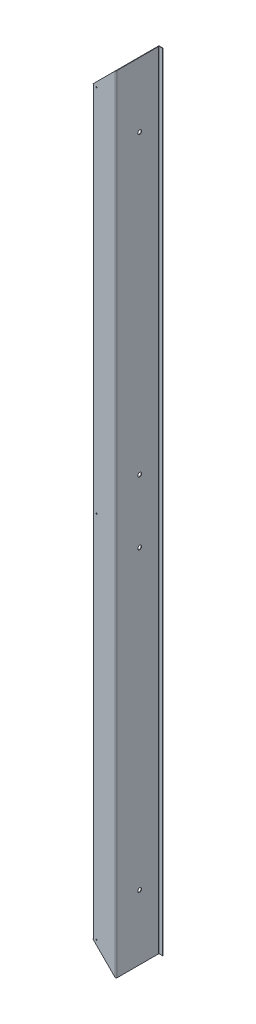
ISO-10303-21;
HEADER;
FILE_DESCRIPTION(('STEP AP214'),'2;1');
FILE_NAME('part.step','',(''),(''),'','','');
FILE_SCHEMA(('AUTOMOTIVE_DESIGN { 1 0 10303 214 1 1 1 1 }'));
ENDSEC;
DATA;
#1=APPLICATION_CONTEXT('core data for automotive mechanical design processes');
#2=APPLICATION_PROTOCOL_DEFINITION('international standard','automotive_design',2000,#1);
#3=PRODUCT_CONTEXT('',#1,'mechanical');
#4=PRODUCT('Part','Part','',(#3));
#5=PRODUCT_RELATED_PRODUCT_CATEGORY('part','',(#4));
#6=PRODUCT_DEFINITION_FORMATION('','',#4);
#7=PRODUCT_DEFINITION_CONTEXT('part definition',#1,'design');
#8=PRODUCT_DEFINITION('design','',#6,#7);
#9=PRODUCT_DEFINITION_SHAPE('','',#8);
#10=(LENGTH_UNIT() NAMED_UNIT(*) SI_UNIT(.MILLI.,.METRE.));
#11=(NAMED_UNIT(*) PLANE_ANGLE_UNIT() SI_UNIT($,.RADIAN.));
#12=(NAMED_UNIT(*) SI_UNIT($,.STERADIAN.) SOLID_ANGLE_UNIT());
#13=UNCERTAINTY_MEASURE_WITH_UNIT(LENGTH_MEASURE(1.E-05),#10,'distance_accuracy_value','');
#14=(GEOMETRIC_REPRESENTATION_CONTEXT(3) GLOBAL_UNCERTAINTY_ASSIGNED_CONTEXT((#13)) GLOBAL_UNIT_ASSIGNED_CONTEXT((#10,
#11,#12)) REPRESENTATION_CONTEXT('',''));
#15=CARTESIAN_POINT('',(0.,0.,0.));
#16=DIRECTION('',(0.,0.,1.));
#17=DIRECTION('',(1.,0.,0.));
#18=AXIS2_PLACEMENT_3D('',#15,#16,#17);
#19=CARTESIAN_POINT('',(457.5,1019.,-111.400000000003));
#20=DIRECTION('',(0.,1.,0.));
#21=DIRECTION('',(-1.,0.,0.));
#22=AXIS2_PLACEMENT_3D('',#19,#20,#21);
#23=PLANE('',#22);
#24=DIRECTION('',(0.,0.,-1.));
#25=VECTOR('',#24,1.);
#26=CARTESIAN_POINT('',(457.5,1019.,-111.400000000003));
#27=LINE('',#26,#25);
#28=CARTESIAN_POINT('',(457.499999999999,1019.,-0.99999999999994));
#29=VERTEX_POINT('',#28);
#30=CARTESIAN_POINT('',(457.5,1019.,-109.200000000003));
#31=VERTEX_POINT('',#30);
#32=EDGE_CURVE('E300',#29,#31,#27,.T.);
#33=ORIENTED_EDGE('',*,*,#32,.T.);
#34=DIRECTION('',(-1.,0.,0.));
#35=VECTOR('',#34,1.);
#36=CARTESIAN_POINT('',(457.5,1019.,-109.200000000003));
#37=LINE('',#36,#35);
#38=CARTESIAN_POINT('',(456.3,1019.,-109.200000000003));
#39=VERTEX_POINT('',#38);
#40=EDGE_CURVE('E284',#31,#39,#37,.T.);
#41=ORIENTED_EDGE('',*,*,#40,.T.);
#42=DIRECTION('',(0.,0.,1.));
#43=VECTOR('',#42,1.);
#44=CARTESIAN_POINT('',(456.299999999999,1019.,1.59582102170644E-12));
#45=LINE('',#44,#43);
#46=CARTESIAN_POINT('',(456.299999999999,1019.,-0.999999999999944));
#47=VERTEX_POINT('',#46);
#48=EDGE_CURVE('E304',#47,#39,#45,.F.);
#49=ORIENTED_EDGE('',*,*,#48,.F.);
#50=DIRECTION('',(1.,0.,0.));
#51=VECTOR('',#50,1.);
#52=CARTESIAN_POINT('',(457.499999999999,1019.,-1.));
#53=LINE('',#52,#51);
#54=EDGE_CURVE('E295',#47,#29,#53,.T.);
#55=ORIENTED_EDGE('',*,*,#54,.T.);
#56=EDGE_LOOP('',(#33,#41,#49,#55));
#57=FACE_BOUND('',#56,.T.);
#58=ADVANCED_FACE('F101',(#57),#23,.T.);
#59=CARTESIAN_POINT('',(457.499999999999,0.,1.60001079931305E-12));
#60=DIRECTION('',(1.,0.,0.));
#61=DIRECTION('',(0.,0.,-1.));
#62=AXIS2_PLACEMENT_3D('',#59,#60,#61);
#63=PLANE('',#62);
#64=CARTESIAN_POINT('',(457.5,-850.999999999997,-60.2999999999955));
#65=DIRECTION('',(1.,0.,0.));
#66=DIRECTION('',(0.,0.,-1.));
#67=AXIS2_PLACEMENT_3D('',#64,#65,#66);
#68=CIRCLE('',#67,5.00000000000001);
#69=CARTESIAN_POINT('',(457.5,-850.999999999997,-65.2999999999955));
#70=VERTEX_POINT('',#69);
#71=EDGE_CURVE('E503',#70,#70,#68,.T.);
#72=ORIENTED_EDGE('',*,*,#71,.F.);
#73=EDGE_LOOP('',(#72));
#74=FACE_BOUND('',#73,.T.);
#75=CARTESIAN_POINT('',(457.499999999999,851.000000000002,-60.2999999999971));
#76=DIRECTION('',(1.,0.,0.));
#77=DIRECTION('',(0.,0.,-1.));
#78=AXIS2_PLACEMENT_3D('',#75,#76,#77);
#79=CIRCLE('',#78,5.00000000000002);
#80=CARTESIAN_POINT('',(457.499999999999,851.000000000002,-65.2999999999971));
#81=VERTEX_POINT('',#80);
#82=EDGE_CURVE('E504',#81,#81,#79,.T.);
#83=ORIENTED_EDGE('',*,*,#82,.F.);
#84=EDGE_LOOP('',(#83));
#85=FACE_BOUND('',#84,.T.);
#86=CARTESIAN_POINT('',(457.5,81.799999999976,-60.2999999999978));
#87=DIRECTION('',(1.,0.,0.));
#88=DIRECTION('',(0.,0.,1.));
#89=AXIS2_PLACEMENT_3D('',#86,#87,#88);
#90=CIRCLE('',#89,5.00000000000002);
#91=CARTESIAN_POINT('',(457.5,81.799999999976,-55.2999999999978));
#92=VERTEX_POINT('',#91);
#93=EDGE_CURVE('E514',#92,#92,#90,.T.);
#94=ORIENTED_EDGE('',*,*,#93,.F.);
#95=EDGE_LOOP('',(#94));
#96=FACE_BOUND('',#95,.T.);
#97=CARTESIAN_POINT('',(457.5,-81.799999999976,-60.2999999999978));
#98=DIRECTION('',(1.,0.,0.));
#99=DIRECTION('',(0.,0.,-1.));
#100=AXIS2_PLACEMENT_3D('',#97,#98,#99);
#101=CIRCLE('',#100,5.00000000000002);
#102=CARTESIAN_POINT('',(457.5,-81.799999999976,-65.2999999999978));
#103=VERTEX_POINT('',#102);
#104=EDGE_CURVE('E496',#103,#103,#101,.T.);
#105=ORIENTED_EDGE('',*,*,#104,.F.);
#106=EDGE_LOOP('',(#105));
#107=FACE_BOUND('',#106,.T.);
#108=DIRECTION('',(0.,0.,1.));
#109=VECTOR('',#108,1.);
#110=CARTESIAN_POINT('',(457.499999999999,-1019.,3.78673207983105E-13));
#111=LINE('',#110,#109);
#112=CARTESIAN_POINT('',(457.5,-1019.,-109.200000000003));
#113=VERTEX_POINT('',#112);
#114=CARTESIAN_POINT('',(457.499999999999,-1019.,-0.999999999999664));
#115=VERTEX_POINT('',#114);
#116=EDGE_CURVE('E297',#113,#115,#111,.T.);
#117=ORIENTED_EDGE('',*,*,#116,.F.);
#118=DIRECTION('',(0.,1.,0.));
#119=VECTOR('',#118,1.);
#120=CARTESIAN_POINT('',(457.5,1019.,-109.200000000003));
#121=LINE('',#120,#119);
#122=EDGE_CURVE('E125',#31,#113,#121,.F.);
#123=ORIENTED_EDGE('',*,*,#122,.F.);
#124=ORIENTED_EDGE('',*,*,#32,.F.);
#125=DIRECTION('',(0.,-1.,0.));
#126=VECTOR('',#125,1.);
#127=CARTESIAN_POINT('',(457.499999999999,0.,-0.99999999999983));
#128=LINE('',#127,#126);
#129=EDGE_CURVE('E307',#29,#115,#128,.T.);
#130=ORIENTED_EDGE('',*,*,#129,.T.);
#131=EDGE_LOOP('',(#117,#123,#124,#130));
#132=FACE_BOUND('',#131,.T.);
#133=ADVANCED_FACE('F454',(#74,#85,#96,#107,#132),#63,.T.);
#134=CARTESIAN_POINT('',(456.299999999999,0.,1.59582102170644E-12));
#135=DIRECTION('',(1.,0.,0.));
#136=DIRECTION('',(0.,0.,-1.));
#137=AXIS2_PLACEMENT_3D('',#134,#135,#136);
#138=PLANE('',#137);
#139=CARTESIAN_POINT('',(456.3,-850.999999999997,-60.2999999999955));
#140=DIRECTION('',(1.,0.,0.));
#141=DIRECTION('',(0.,0.,-1.));
#142=AXIS2_PLACEMENT_3D('',#139,#140,#141);
#143=CIRCLE('',#142,5.00000000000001);
#144=CARTESIAN_POINT('',(456.3,-850.999999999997,-65.2999999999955));
#145=VERTEX_POINT('',#144);
#146=EDGE_CURVE('E499',#145,#145,#143,.F.);
#147=ORIENTED_EDGE('',*,*,#146,.F.);
#148=EDGE_LOOP('',(#147));
#149=FACE_BOUND('',#148,.T.);
#150=CARTESIAN_POINT('',(456.3,851.000000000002,-60.2999999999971));
#151=DIRECTION('',(1.,0.,0.));
#152=DIRECTION('',(0.,0.,-1.));
#153=AXIS2_PLACEMENT_3D('',#150,#151,#152);
#154=CIRCLE('',#153,5.00000000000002);
#155=CARTESIAN_POINT('',(456.3,851.000000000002,-65.2999999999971));
#156=VERTEX_POINT('',#155);
#157=EDGE_CURVE('E500',#156,#156,#154,.F.);
#158=ORIENTED_EDGE('',*,*,#157,.F.);
#159=EDGE_LOOP('',(#158));
#160=FACE_BOUND('',#159,.T.);
#161=CARTESIAN_POINT('',(456.3,81.799999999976,-60.2999999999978));
#162=DIRECTION('',(1.,0.,0.));
#163=DIRECTION('',(0.,0.,-1.));
#164=AXIS2_PLACEMENT_3D('',#161,#162,#163);
#165=CIRCLE('',#164,5.00000000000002);
#166=CARTESIAN_POINT('',(456.3,81.799999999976,-65.2999999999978));
#167=VERTEX_POINT('',#166);
#168=EDGE_CURVE('E507',#167,#167,#165,.F.);
#169=ORIENTED_EDGE('',*,*,#168,.F.);
#170=EDGE_LOOP('',(#169));
#171=FACE_BOUND('',#170,.T.);
#172=CARTESIAN_POINT('',(456.3,-81.799999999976,-60.2999999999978));
#173=DIRECTION('',(1.,0.,0.));
#174=DIRECTION('',(0.,0.,-1.));
#175=AXIS2_PLACEMENT_3D('',#172,#173,#174);
#176=CIRCLE('',#175,5.00000000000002);
#177=CARTESIAN_POINT('',(456.3,-81.799999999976,-65.2999999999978));
#178=VERTEX_POINT('',#177);
#179=EDGE_CURVE('E481',#178,#178,#176,.F.);
#180=ORIENTED_EDGE('',*,*,#179,.F.);
#181=EDGE_LOOP('',(#180));
#182=FACE_BOUND('',#181,.T.);
#183=DIRECTION('',(0.,1.,0.));
#184=VECTOR('',#183,1.);
#185=CARTESIAN_POINT('',(456.3,1019.,-109.200000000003));
#186=LINE('',#185,#184);
#187=CARTESIAN_POINT('',(456.3,-1019.,-109.200000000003));
#188=VERTEX_POINT('',#187);
#189=EDGE_CURVE('E278',#39,#188,#186,.F.);
#190=ORIENTED_EDGE('',*,*,#189,.T.);
#191=DIRECTION('',(0.,0.,-1.));
#192=VECTOR('',#191,1.);
#193=CARTESIAN_POINT('',(456.299999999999,-1019.,1.59582102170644E-12));
#194=LINE('',#193,#192);
#195=CARTESIAN_POINT('',(456.299999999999,-1019.,-0.999999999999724));
#196=VERTEX_POINT('',#195);
#197=EDGE_CURVE('E302',#188,#196,#194,.F.);
#198=ORIENTED_EDGE('',*,*,#197,.T.);
#199=DIRECTION('',(0.,1.,0.));
#200=VECTOR('',#199,1.);
#201=CARTESIAN_POINT('',(456.299999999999,1019.,-1.));
#202=LINE('',#201,#200);
#203=EDGE_CURVE('E313',#47,#196,#202,.F.);
#204=ORIENTED_EDGE('',*,*,#203,.F.);
#205=ORIENTED_EDGE('',*,*,#48,.T.);
#206=EDGE_LOOP('',(#190,#198,#204,#205));
#207=FACE_BOUND('',#206,.T.);
#208=ADVANCED_FACE('F443',(#149,#160,#171,#182,#207),#138,.F.);
#209=CARTESIAN_POINT('',(0.,0.,1.2));
#210=DIRECTION('',(0.,0.,-1.));
#211=DIRECTION('',(-1.,0.,0.));
#212=AXIS2_PLACEMENT_3D('',#209,#210,#211);
#213=PLANE('',#212);
#214=CARTESIAN_POINT('',(407.100000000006,-957.299999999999,1.2));
#215=DIRECTION('',(0.,0.,1.));
#216=DIRECTION('',(1.,0.,0.));
#217=AXIS2_PLACEMENT_3D('',#214,#215,#216);
#218=CIRCLE('',#217,1.50000000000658);
#219=CARTESIAN_POINT('',(408.600000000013,-957.299999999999,1.2));
#220=VERTEX_POINT('',#219);
#221=EDGE_CURVE('E490',#220,#220,#218,.T.);
#222=ORIENTED_EDGE('',*,*,#221,.F.);
#223=EDGE_LOOP('',(#222));
#224=FACE_BOUND('',#223,.T.);
#225=CARTESIAN_POINT('',(407.100000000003,0.,1.2));
#226=DIRECTION('',(0.,0.,1.));
#227=DIRECTION('',(1.,0.,0.));
#228=AXIS2_PLACEMENT_3D('',#225,#226,#227);
#229=CIRCLE('',#228,1.50000000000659);
#230=CARTESIAN_POINT('',(408.60000000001,0.,1.2));
#231=VERTEX_POINT('',#230);
#232=EDGE_CURVE('E484',#231,#231,#229,.T.);
#233=ORIENTED_EDGE('',*,*,#232,.F.);
#234=EDGE_LOOP('',(#233));
#235=FACE_BOUND('',#234,.T.);
#236=CARTESIAN_POINT('',(407.1,957.299999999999,1.2));
#237=DIRECTION('',(0.,0.,1.));
#238=DIRECTION('',(1.,0.,0.));
#239=AXIS2_PLACEMENT_3D('',#236,#237,#238);
#240=CIRCLE('',#239,1.50000000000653);
#241=CARTESIAN_POINT('',(408.600000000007,957.299999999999,1.2));
#242=VERTEX_POINT('',#241);
#243=EDGE_CURVE('E477',#242,#242,#240,.T.);
#244=ORIENTED_EDGE('',*,*,#243,.F.);
#245=EDGE_LOOP('',(#244));
#246=FACE_BOUND('',#245,.T.);
#247=DIRECTION('',(0.,-1.,0.));
#248=VECTOR('',#247,1.);
#249=CARTESIAN_POINT('',(455.299999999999,-1019.,1.20000000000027));
#250=LINE('',#249,#248);
#251=CARTESIAN_POINT('',(455.299999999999,-1018.,1.20000000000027));
#252=VERTEX_POINT('',#251);
#253=CARTESIAN_POINT('',(455.299999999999,1018.,1.2));
#254=VERTEX_POINT('',#253);
#255=EDGE_CURVE('E322',#252,#254,#250,.F.);
#256=ORIENTED_EDGE('',*,*,#255,.T.);
#257=DIRECTION('',(-0.707106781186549,-0.707106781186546,0.));
#258=VECTOR('',#257,1.);
#259=CARTESIAN_POINT('',(397.499999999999,960.2,1.2));
#260=LINE('',#259,#258);
#261=CARTESIAN_POINT('',(397.499999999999,960.2,1.2));
#262=VERTEX_POINT('',#261);
#263=EDGE_CURVE('E330',#254,#262,#260,.T.);
#264=ORIENTED_EDGE('',*,*,#263,.T.);
#265=DIRECTION('',(-1.,0.,0.));
#266=VECTOR('',#265,1.);
#267=CARTESIAN_POINT('',(0.,960.2,1.2));
#268=LINE('',#267,#266);
#269=CARTESIAN_POINT('',(399.699999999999,960.2,1.2));
#270=VERTEX_POINT('',#269);
#271=EDGE_CURVE('E1048',#270,#262,#268,.T.);
#272=ORIENTED_EDGE('',*,*,#271,.F.);
#273=DIRECTION('',(0.,1.,0.));
#274=VECTOR('',#273,1.);
#275=CARTESIAN_POINT('',(399.699999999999,960.2,1.19999999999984));
#276=LINE('',#275,#274);
#277=CARTESIAN_POINT('',(399.699999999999,-960.199999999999,1.2));
#278=VERTEX_POINT('',#277);
#279=EDGE_CURVE('E1016',#270,#278,#276,.F.);
#280=ORIENTED_EDGE('',*,*,#279,.T.);
#281=DIRECTION('',(1.,0.,0.));
#282=VECTOR('',#281,1.);
#283=CARTESIAN_POINT('',(0.,-960.199999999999,1.2));
#284=LINE('',#283,#282);
#285=CARTESIAN_POINT('',(397.499999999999,-960.199999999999,1.2));
#286=VERTEX_POINT('',#285);
#287=EDGE_CURVE('E992',#286,#278,#284,.T.);
#288=ORIENTED_EDGE('',*,*,#287,.F.);
#289=DIRECTION('',(0.707106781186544,-0.707106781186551,0.));
#290=VECTOR('',#289,1.);
#291=CARTESIAN_POINT('',(397.499999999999,-960.199999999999,1.2));
#292=LINE('',#291,#290);
#293=EDGE_CURVE('E1019',#286,#252,#292,.T.);
#294=ORIENTED_EDGE('',*,*,#293,.T.);
#295=EDGE_LOOP('',(#256,#264,#272,#280,#288,#294));
#296=FACE_BOUND('',#295,.T.);
#297=ADVANCED_FACE('F440',(#224,#235,#246,#296),#213,.F.);
#298=CARTESIAN_POINT('',(0.,0.,0.));
#299=DIRECTION('',(0.,0.,-1.));
#300=DIRECTION('',(-1.,0.,0.));
#301=AXIS2_PLACEMENT_3D('',#298,#299,#300);
#302=PLANE('',#301);
#303=CARTESIAN_POINT('',(407.100000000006,-957.299999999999,0.));
#304=DIRECTION('',(0.,0.,1.));
#305=DIRECTION('',(1.,0.,0.));
#306=AXIS2_PLACEMENT_3D('',#303,#304,#305);
#307=CIRCLE('',#306,1.50000000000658);
#308=CARTESIAN_POINT('',(408.600000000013,-957.299999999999,0.));
#309=VERTEX_POINT('',#308);
#310=EDGE_CURVE('E277',#309,#309,#307,.T.);
#311=ORIENTED_EDGE('',*,*,#310,.T.);
#312=EDGE_LOOP('',(#311));
#313=FACE_BOUND('',#312,.T.);
#314=CARTESIAN_POINT('',(407.100000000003,0.,0.));
#315=DIRECTION('',(0.,0.,1.));
#316=DIRECTION('',(1.,0.,0.));
#317=AXIS2_PLACEMENT_3D('',#314,#315,#316);
#318=CIRCLE('',#317,1.50000000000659);
#319=CARTESIAN_POINT('',(408.60000000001,0.,0.));
#320=VERTEX_POINT('',#319);
#321=EDGE_CURVE('E487',#320,#320,#318,.T.);
#322=ORIENTED_EDGE('',*,*,#321,.T.);
#323=EDGE_LOOP('',(#322));
#324=FACE_BOUND('',#323,.T.);
#325=CARTESIAN_POINT('',(407.1,957.299999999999,0.));
#326=DIRECTION('',(0.,0.,1.));
#327=DIRECTION('',(1.,0.,0.));
#328=AXIS2_PLACEMENT_3D('',#325,#326,#327);
#329=CIRCLE('',#328,1.50000000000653);
#330=CARTESIAN_POINT('',(408.600000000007,957.299999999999,0.));
#331=VERTEX_POINT('',#330);
#332=EDGE_CURVE('E480',#331,#331,#329,.T.);
#333=ORIENTED_EDGE('',*,*,#332,.T.);
#334=EDGE_LOOP('',(#333));
#335=FACE_BOUND('',#334,.T.);
#336=DIRECTION('',(-0.707106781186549,-0.707106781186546,0.));
#337=VECTOR('',#336,1.);
#338=CARTESIAN_POINT('',(397.499999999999,960.2,0.));
#339=LINE('',#338,#337);
#340=CARTESIAN_POINT('',(455.299999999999,1018.,0.));
#341=VERTEX_POINT('',#340);
#342=CARTESIAN_POINT('',(397.499999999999,960.2,0.));
#343=VERTEX_POINT('',#342);
#344=EDGE_CURVE('E105',#341,#343,#339,.T.);
#345=ORIENTED_EDGE('',*,*,#344,.F.);
#346=DIRECTION('',(0.,-1.,0.));
#347=VECTOR('',#346,1.);
#348=CARTESIAN_POINT('',(455.299999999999,-1019.,2.73652628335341E-13));
#349=LINE('',#348,#347);
#350=CARTESIAN_POINT('',(455.299999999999,-1018.,2.73598418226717E-13));
#351=VERTEX_POINT('',#350);
#352=EDGE_CURVE('E318',#351,#341,#349,.F.);
#353=ORIENTED_EDGE('',*,*,#352,.F.);
#354=DIRECTION('',(0.707106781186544,-0.707106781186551,0.));
#355=VECTOR('',#354,1.);
#356=CARTESIAN_POINT('',(397.499999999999,-960.199999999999,0.));
#357=LINE('',#356,#355);
#358=CARTESIAN_POINT('',(397.499999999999,-960.199999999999,0.));
#359=VERTEX_POINT('',#358);
#360=EDGE_CURVE('E999',#359,#351,#357,.T.);
#361=ORIENTED_EDGE('',*,*,#360,.F.);
#362=DIRECTION('',(-1.,0.,0.));
#363=VECTOR('',#362,1.);
#364=CARTESIAN_POINT('',(399.699999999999,-960.199999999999,0.));
#365=LINE('',#364,#363);
#366=CARTESIAN_POINT('',(397.740408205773,-960.199999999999,0.));
#367=VERTEX_POINT('',#366);
#368=EDGE_CURVE('E986',#367,#359,#365,.T.);
#369=ORIENTED_EDGE('',*,*,#368,.F.);
#370=CARTESIAN_POINT('',(399.699999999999,-960.199999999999,0.));
#371=VERTEX_POINT('',#370);
#372=EDGE_CURVE('E985',#371,#367,#365,.T.);
#373=ORIENTED_EDGE('',*,*,#372,.F.);
#374=DIRECTION('',(0.,1.,0.));
#375=VECTOR('',#374,1.);
#376=CARTESIAN_POINT('',(399.699999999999,960.2,-1.59811400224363E-13));
#377=LINE('',#376,#375);
#378=CARTESIAN_POINT('',(399.699999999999,960.2,-1.59811400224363E-13));
#379=VERTEX_POINT('',#378);
#380=EDGE_CURVE('E1006',#379,#371,#377,.F.);
#381=ORIENTED_EDGE('',*,*,#380,.F.);
#382=DIRECTION('',(1.,0.,0.));
#383=VECTOR('',#382,1.);
#384=CARTESIAN_POINT('',(397.499999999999,960.2,0.));
#385=LINE('',#384,#383);
#386=CARTESIAN_POINT('',(397.740408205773,960.2,0.));
#387=VERTEX_POINT('',#386);
#388=EDGE_CURVE('E1000',#387,#379,#385,.T.);
#389=ORIENTED_EDGE('',*,*,#388,.F.);
#390=EDGE_CURVE('E984',#343,#387,#385,.T.);
#391=ORIENTED_EDGE('',*,*,#390,.F.);
#392=EDGE_LOOP('',(#345,#353,#361,#369,#373,#381,#389,#391));
#393=FACE_BOUND('',#392,.T.);
#394=ADVANCED_FACE('F442',(#313,#324,#335,#393),#302,.T.);
#395=CARTESIAN_POINT('',(397.499999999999,-960.199999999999,1.2));
#396=DIRECTION('',(0.707106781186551,0.707106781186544,0.));
#397=DIRECTION('',(-0.707106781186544,0.707106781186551,0.));
#398=AXIS2_PLACEMENT_3D('',#395,#396,#397);
#399=PLANE('',#398);
#400=DIRECTION('',(0.,0.,1.));
#401=VECTOR('',#400,1.);
#402=CARTESIAN_POINT('',(455.299999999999,-1018.,2.73544208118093E-13));
#403=LINE('',#402,#401);
#404=EDGE_CURVE('E331',#351,#252,#403,.T.);
#405=ORIENTED_EDGE('',*,*,#404,.T.);
#406=ORIENTED_EDGE('',*,*,#293,.F.);
#407=DIRECTION('',(0.,0.,-1.));
#408=VECTOR('',#407,1.);
#409=CARTESIAN_POINT('',(397.499999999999,-960.199999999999,1.2));
#410=LINE('',#409,#408);
#411=EDGE_CURVE('E378',#286,#359,#410,.T.);
#412=ORIENTED_EDGE('',*,*,#411,.T.);
#413=ORIENTED_EDGE('',*,*,#360,.T.);
#414=EDGE_LOOP('',(#405,#406,#412,#413));
#415=FACE_BOUND('',#414,.T.);
#416=ADVANCED_FACE('F103',(#415),#399,.F.);
#417=CARTESIAN_POINT('',(397.499999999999,960.2,0.));
#418=DIRECTION('',(0.,-1.,0.));
#419=DIRECTION('',(0.,0.,-1.));
#420=AXIS2_PLACEMENT_3D('',#417,#418,#419);
#421=PLANE('',#420);
#422=ORIENTED_EDGE('',*,*,#390,.T.);
#423=CARTESIAN_POINT('',(399.699999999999,960.2,-1.00000000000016));
#424=DIRECTION('',(0.,1.,0.));
#425=DIRECTION('',(0.,0.,1.));
#426=AXIS2_PLACEMENT_3D('',#423,#424,#425);
#427=CIRCLE('',#426,2.2);
#428=EDGE_CURVE('E998',#387,#270,#427,.T.);
#429=ORIENTED_EDGE('',*,*,#428,.T.);
#430=ORIENTED_EDGE('',*,*,#271,.T.);
#431=DIRECTION('',(0.,0.,-1.));
#432=VECTOR('',#431,1.);
#433=CARTESIAN_POINT('',(397.499999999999,960.2,1.2));
#434=LINE('',#433,#432);
#435=EDGE_CURVE('E1050',#262,#343,#434,.T.);
#436=ORIENTED_EDGE('',*,*,#435,.T.);
#437=EDGE_LOOP('',(#422,#429,#430,#436));
#438=FACE_BOUND('',#437,.T.);
#439=ADVANCED_FACE('F386',(#438),#421,.T.);
#440=CARTESIAN_POINT('',(399.699999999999,-960.199999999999,0.));
#441=DIRECTION('',(0.,1.,0.));
#442=DIRECTION('',(0.,0.,1.));
#443=AXIS2_PLACEMENT_3D('',#440,#441,#442);
#444=PLANE('',#443);
#445=ORIENTED_EDGE('',*,*,#287,.T.);
#446=CARTESIAN_POINT('',(399.699999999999,-960.199999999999,-0.999999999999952));
#447=DIRECTION('',(0.,1.,0.));
#448=DIRECTION('',(0.,0.,1.));
#449=AXIS2_PLACEMENT_3D('',#446,#447,#448);
#450=CIRCLE('',#449,2.2);
#451=EDGE_CURVE('E990',#278,#367,#450,.F.);
#452=ORIENTED_EDGE('',*,*,#451,.T.);
#453=ORIENTED_EDGE('',*,*,#368,.T.);
#454=ORIENTED_EDGE('',*,*,#411,.F.);
#455=EDGE_LOOP('',(#445,#452,#453,#454));
#456=FACE_BOUND('',#455,.T.);
#457=ADVANCED_FACE('F395',(#456),#444,.T.);
#458=CARTESIAN_POINT('',(397.499999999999,960.2,1.2));
#459=DIRECTION('',(0.707106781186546,-0.707106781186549,0.));
#460=DIRECTION('',(0.707106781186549,0.707106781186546,0.));
#461=AXIS2_PLACEMENT_3D('',#458,#459,#460);
#462=PLANE('',#461);
#463=ORIENTED_EDGE('',*,*,#263,.F.);
#464=DIRECTION('',(0.,0.,1.));
#465=VECTOR('',#464,1.);
#466=CARTESIAN_POINT('',(455.299999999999,1018.,0.));
#467=LINE('',#466,#465);
#468=EDGE_CURVE('E327',#341,#254,#467,.T.);
#469=ORIENTED_EDGE('',*,*,#468,.F.);
#470=ORIENTED_EDGE('',*,*,#344,.T.);
#471=ORIENTED_EDGE('',*,*,#435,.F.);
#472=EDGE_LOOP('',(#463,#469,#470,#471));
#473=FACE_BOUND('',#472,.T.);
#474=ADVANCED_FACE('F399',(#473),#462,.F.);
#475=CARTESIAN_POINT('',(399.699999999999,-960.199999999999,-0.999999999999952));
#476=DIRECTION('',(0.,-1.,0.));
#477=DIRECTION('',(0.,0.,-1.));
#478=AXIS2_PLACEMENT_3D('',#475,#476,#477);
#479=PLANE('',#478);
#480=CARTESIAN_POINT('',(399.699999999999,-960.199999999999,-0.999999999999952));
#481=DIRECTION('',(0.,1.,0.));
#482=DIRECTION('',(0.,0.,1.));
#483=AXIS2_PLACEMENT_3D('',#480,#481,#482);
#484=CIRCLE('',#483,1.);
#485=CARTESIAN_POINT('',(398.699999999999,-960.199999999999,-0.999999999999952));
#486=VERTEX_POINT('',#485);
#487=EDGE_CURVE('E1009',#371,#486,#484,.F.);
#488=ORIENTED_EDGE('',*,*,#487,.F.);
#489=ORIENTED_EDGE('',*,*,#372,.T.);
#490=CARTESIAN_POINT('',(397.499999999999,-960.199999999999,-0.999999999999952));
#491=VERTEX_POINT('',#490);
#492=EDGE_CURVE('E988',#367,#491,#450,.F.);
#493=ORIENTED_EDGE('',*,*,#492,.T.);
#494=DIRECTION('',(-1.,0.,0.));
#495=VECTOR('',#494,1.);
#496=CARTESIAN_POINT('',(397.499999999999,-960.199999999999,-1.));
#497=LINE('',#496,#495);
#498=EDGE_CURVE('E1020',#486,#491,#497,.T.);
#499=ORIENTED_EDGE('',*,*,#498,.F.);
#500=EDGE_LOOP('',(#488,#489,#493,#499));
#501=FACE_BOUND('',#500,.T.);
#502=ADVANCED_FACE('F405',(#501),#479,.T.);
#503=CARTESIAN_POINT('',(399.699999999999,960.2,-1.00000000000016));
#504=DIRECTION('',(0.,-1.,0.));
#505=DIRECTION('',(0.,0.,-1.));
#506=AXIS2_PLACEMENT_3D('',#503,#504,#505);
#507=PLANE('',#506);
#508=CARTESIAN_POINT('',(397.499999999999,960.2,-1.00000000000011));
#509=VERTEX_POINT('',#508);
#510=EDGE_CURVE('E1013',#509,#387,#427,.T.);
#511=ORIENTED_EDGE('',*,*,#510,.T.);
#512=ORIENTED_EDGE('',*,*,#388,.T.);
#513=CARTESIAN_POINT('',(399.699999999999,960.2,-1.00000000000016));
#514=DIRECTION('',(0.,1.,0.));
#515=DIRECTION('',(0.,0.,1.));
#516=AXIS2_PLACEMENT_3D('',#513,#514,#515);
#517=CIRCLE('',#516,1.);
#518=CARTESIAN_POINT('',(398.699999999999,960.2,-1.00000000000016));
#519=VERTEX_POINT('',#518);
#520=EDGE_CURVE('E1001',#519,#379,#517,.T.);
#521=ORIENTED_EDGE('',*,*,#520,.F.);
#522=DIRECTION('',(-1.,0.,0.));
#523=VECTOR('',#522,1.);
#524=CARTESIAN_POINT('',(398.699999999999,960.2,-1.00000000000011));
#525=LINE('',#524,#523);
#526=EDGE_CURVE('E1010',#519,#509,#525,.T.);
#527=ORIENTED_EDGE('',*,*,#526,.T.);
#528=EDGE_LOOP('',(#511,#512,#521,#527));
#529=FACE_BOUND('',#528,.T.);
#530=ADVANCED_FACE('F401',(#529),#507,.F.);
#531=CARTESIAN_POINT('',(399.699999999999,960.2,-1.00000000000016));
#532=DIRECTION('',(0.,1.,0.));
#533=DIRECTION('',(-1.,0.,0.));
#534=AXIS2_PLACEMENT_3D('',#531,#532,#533);
#535=CYLINDRICAL_SURFACE('',#534,2.2);
#536=ORIENTED_EDGE('',*,*,#279,.F.);
#537=ORIENTED_EDGE('',*,*,#428,.F.);
#538=ORIENTED_EDGE('',*,*,#510,.F.);
#539=DIRECTION('',(0.,1.,0.));
#540=VECTOR('',#539,1.);
#541=CARTESIAN_POINT('',(397.499999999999,0.,-1.00000000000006));
#542=LINE('',#541,#540);
#543=EDGE_CURVE('E1027',#491,#509,#542,.T.);
#544=ORIENTED_EDGE('',*,*,#543,.F.);
#545=ORIENTED_EDGE('',*,*,#492,.F.);
#546=ORIENTED_EDGE('',*,*,#451,.F.);
#547=EDGE_LOOP('',(#536,#537,#538,#544,#545,#546));
#548=FACE_BOUND('',#547,.T.);
#549=ADVANCED_FACE('F404',(#548),#535,.T.);
#550=CARTESIAN_POINT('',(399.699999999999,960.2,-1.00000000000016));
#551=DIRECTION('',(0.,1.,0.));
#552=DIRECTION('',(-1.,0.,0.));
#553=AXIS2_PLACEMENT_3D('',#550,#551,#552);
#554=CYLINDRICAL_SURFACE('',#553,1.);
#555=ORIENTED_EDGE('',*,*,#380,.T.);
#556=ORIENTED_EDGE('',*,*,#487,.T.);
#557=DIRECTION('',(0.,-1.,0.));
#558=VECTOR('',#557,1.);
#559=CARTESIAN_POINT('',(398.699999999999,-960.199999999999,-1.));
#560=LINE('',#559,#558);
#561=EDGE_CURVE('E1005',#486,#519,#560,.F.);
#562=ORIENTED_EDGE('',*,*,#561,.T.);
#563=ORIENTED_EDGE('',*,*,#520,.T.);
#564=EDGE_LOOP('',(#555,#556,#562,#563));
#565=FACE_BOUND('',#564,.T.);
#566=ADVANCED_FACE('F410',(#565),#554,.F.);
#567=CARTESIAN_POINT('',(397.499999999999,960.2,0.));
#568=DIRECTION('',(0.,1.,0.));
#569=DIRECTION('',(0.,0.,1.));
#570=AXIS2_PLACEMENT_3D('',#567,#568,#569);
#571=PLANE('',#570);
#572=DIRECTION('',(0.,0.,1.));
#573=VECTOR('',#572,1.);
#574=CARTESIAN_POINT('',(397.499999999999,960.2,0.));
#575=LINE('',#574,#573);
#576=CARTESIAN_POINT('',(397.499999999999,960.2,-9.8));
#577=VERTEX_POINT('',#576);
#578=EDGE_CURVE('E1004',#577,#509,#575,.T.);
#579=ORIENTED_EDGE('',*,*,#578,.T.);
#580=ORIENTED_EDGE('',*,*,#526,.F.);
#581=DIRECTION('',(0.,0.,-1.));
#582=VECTOR('',#581,1.);
#583=CARTESIAN_POINT('',(398.699999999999,960.2,2.17558397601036E-11));
#584=LINE('',#583,#582);
#585=CARTESIAN_POINT('',(398.699999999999,960.2,-9.8));
#586=VERTEX_POINT('',#585);
#587=EDGE_CURVE('E1036',#586,#519,#584,.F.);
#588=ORIENTED_EDGE('',*,*,#587,.F.);
#589=DIRECTION('',(1.,0.,0.));
#590=VECTOR('',#589,1.);
#591=CARTESIAN_POINT('',(397.499999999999,960.2,-9.8));
#592=LINE('',#591,#590);
#593=EDGE_CURVE('E13',#577,#586,#592,.T.);
#594=ORIENTED_EDGE('',*,*,#593,.F.);
#595=EDGE_LOOP('',(#579,#580,#588,#594));
#596=FACE_BOUND('',#595,.T.);
#597=ADVANCED_FACE('F413',(#596),#571,.T.);
#598=CARTESIAN_POINT('',(397.499999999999,-960.199999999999,-9.8));
#599=DIRECTION('',(0.,-1.,0.));
#600=DIRECTION('',(1.,0.,0.));
#601=AXIS2_PLACEMENT_3D('',#598,#599,#600);
#602=PLANE('',#601);
#603=DIRECTION('',(0.,0.,1.));
#604=VECTOR('',#603,1.);
#605=CARTESIAN_POINT('',(398.699999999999,-960.199999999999,0.));
#606=LINE('',#605,#604);
#607=CARTESIAN_POINT('',(398.699999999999,-960.199999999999,-9.8));
#608=VERTEX_POINT('',#607);
#609=EDGE_CURVE('E1030',#486,#608,#606,.F.);
#610=ORIENTED_EDGE('',*,*,#609,.F.);
#611=ORIENTED_EDGE('',*,*,#498,.T.);
#612=DIRECTION('',(0.,0.,-1.));
#613=VECTOR('',#612,1.);
#614=CARTESIAN_POINT('',(397.499999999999,-960.199999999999,-9.8));
#615=LINE('',#614,#613);
#616=CARTESIAN_POINT('',(397.499999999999,-960.199999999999,-9.8));
#617=VERTEX_POINT('',#616);
#618=EDGE_CURVE('E1023',#491,#617,#615,.T.);
#619=ORIENTED_EDGE('',*,*,#618,.T.);
#620=DIRECTION('',(1.,0.,0.));
#621=VECTOR('',#620,1.);
#622=CARTESIAN_POINT('',(397.499999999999,-960.199999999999,-9.8));
#623=LINE('',#622,#621);
#624=EDGE_CURVE('E1031',#617,#608,#623,.T.);
#625=ORIENTED_EDGE('',*,*,#624,.T.);
#626=EDGE_LOOP('',(#610,#611,#619,#625));
#627=FACE_BOUND('',#626,.T.);
#628=ADVANCED_FACE('F418',(#627),#602,.T.);
#629=CARTESIAN_POINT('',(397.499999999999,0.,0.));
#630=DIRECTION('',(-1.,0.,0.));
#631=DIRECTION('',(0.,-1.,0.));
#632=AXIS2_PLACEMENT_3D('',#629,#630,#631);
#633=PLANE('',#632);
#634=ORIENTED_EDGE('',*,*,#618,.F.);
#635=ORIENTED_EDGE('',*,*,#543,.T.);
#636=ORIENTED_EDGE('',*,*,#578,.F.);
#637=DIRECTION('',(0.,1.,0.));
#638=VECTOR('',#637,1.);
#639=CARTESIAN_POINT('',(397.499999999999,960.2,-9.8));
#640=LINE('',#639,#638);
#641=EDGE_CURVE('E110',#617,#577,#640,.T.);
#642=ORIENTED_EDGE('',*,*,#641,.F.);
#643=EDGE_LOOP('',(#634,#635,#636,#642));
#644=FACE_BOUND('',#643,.T.);
#645=ADVANCED_FACE('F421',(#644),#633,.T.);
#646=CARTESIAN_POINT('',(398.699999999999,0.,0.));
#647=DIRECTION('',(-1.,0.,0.));
#648=DIRECTION('',(0.,-1.,0.));
#649=AXIS2_PLACEMENT_3D('',#646,#647,#648);
#650=PLANE('',#649);
#651=ORIENTED_EDGE('',*,*,#561,.F.);
#652=ORIENTED_EDGE('',*,*,#609,.T.);
#653=DIRECTION('',(0.,-1.,0.));
#654=VECTOR('',#653,1.);
#655=CARTESIAN_POINT('',(398.699999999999,0.,-9.8));
#656=LINE('',#655,#654);
#657=EDGE_CURVE('E1033',#608,#586,#656,.F.);
#658=ORIENTED_EDGE('',*,*,#657,.T.);
#659=ORIENTED_EDGE('',*,*,#587,.T.);
#660=EDGE_LOOP('',(#651,#652,#658,#659));
#661=FACE_BOUND('',#660,.T.);
#662=ADVANCED_FACE('F426',(#661),#650,.F.);
#663=CARTESIAN_POINT('',(397.499999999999,960.2,-9.8));
#664=DIRECTION('',(0.,0.,-1.));
#665=DIRECTION('',(-1.,0.,0.));
#666=AXIS2_PLACEMENT_3D('',#663,#664,#665);
#667=PLANE('',#666);
#668=ORIENTED_EDGE('',*,*,#657,.F.);
#669=ORIENTED_EDGE('',*,*,#624,.F.);
#670=ORIENTED_EDGE('',*,*,#641,.T.);
#671=ORIENTED_EDGE('',*,*,#593,.T.);
#672=EDGE_LOOP('',(#668,#669,#670,#671));
#673=FACE_BOUND('',#672,.T.);
#674=ADVANCED_FACE('F423',(#673),#667,.T.);
#675=CARTESIAN_POINT('',(455.299999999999,1018.,1.21200000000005));
#676=CARTESIAN_POINT('',(455.589598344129,1018.08334722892,1.21200000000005));
#677=CARTESIAN_POINT('',(455.878986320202,1018.16666666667,1.15442756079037));
#678=CARTESIAN_POINT('',(456.41400518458,1018.33333333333,0.932815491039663));
#679=CARTESIAN_POINT('',(456.659377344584,1018.41666666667,0.768863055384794));
#680=CARTESIAN_POINT('',(457.068863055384,1018.58333333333,0.359377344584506));
#681=CARTESIAN_POINT('',(457.232815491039,1018.66666666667,0.114005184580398));
#682=CARTESIAN_POINT('',(457.45442756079,1018.83333333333,-0.421013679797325));
#683=CARTESIAN_POINT('',(457.511999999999,1018.91665277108,-0.710401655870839));
#684=CARTESIAN_POINT('',(457.511999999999,1019.,-1.00000000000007));
#685=CARTESIAN_POINT('',(455.299999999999,1018.,1.20000000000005));
#686=CARTESIAN_POINT('',(455.588027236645,1018.08334719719,1.20000000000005));
#687=CARTESIAN_POINT('',(455.87584534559,1018.16666666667,1.14273988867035));
#688=CARTESIAN_POINT('',(456.407961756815,1018.33333333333,0.922330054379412));
#689=CARTESIAN_POINT('',(456.652002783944,1018.41666666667,0.759267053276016));
#690=CARTESIAN_POINT('',(457.059267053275,1018.58333333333,0.352002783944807));
#691=CARTESIAN_POINT('',(457.222330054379,1018.66666666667,0.107961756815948));
#692=CARTESIAN_POINT('',(457.44273988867,1018.83333333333,-0.424154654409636));
#693=CARTESIAN_POINT('',(457.499999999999,1018.9166528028,-0.711972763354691));
#694=CARTESIAN_POINT('',(457.499999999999,1019.,-1.00000000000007));
#695=CARTESIAN_POINT('',(455.299999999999,1018.,0.));
#696=CARTESIAN_POINT('',(455.43091648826,1018.08334402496,0.));
#697=CARTESIAN_POINT('',(455.561747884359,1018.16666666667,-0.0260273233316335));
#698=CARTESIAN_POINT('',(455.80361898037,1018.33333333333,-0.126213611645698));
#699=CARTESIAN_POINT('',(455.914546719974,1018.41666666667,-0.200333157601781));
#700=CARTESIAN_POINT('',(456.099666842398,1018.58333333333,-0.385453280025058));
#701=CARTESIAN_POINT('',(456.173786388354,1018.66666666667,-0.49638101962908));
#702=CARTESIAN_POINT('',(456.273972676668,1018.83333333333,-0.738252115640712));
#703=CARTESIAN_POINT('',(456.299999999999,1018.91665597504,-0.869083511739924));
#704=CARTESIAN_POINT('',(456.299999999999,1019.,-1.));
#705=CARTESIAN_POINT('',(455.299999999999,1018.,-0.0121199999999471));
#706=CARTESIAN_POINT('',(455.429329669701,1018.08334399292,-0.0121199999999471));
#707=CARTESIAN_POINT('',(455.5585755,1018.16666666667,-0.0378318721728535));
#708=CARTESIAN_POINT('',(455.797515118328,1018.33333333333,-0.136803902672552));
#709=CARTESIAN_POINT('',(455.907098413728,1018.41666666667,-0.210025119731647));
#710=CARTESIAN_POINT('',(456.089974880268,1018.58333333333,-0.392901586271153));
#711=CARTESIAN_POINT('',(456.163196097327,1018.66666666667,-0.502484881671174));
#712=CARTESIAN_POINT('',(456.262168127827,1018.83333333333,-0.741424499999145));
#713=CARTESIAN_POINT('',(456.287879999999,1018.91665600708,-0.870670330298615));
#714=CARTESIAN_POINT('',(456.287879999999,1019.,-1.));
#715=B_SPLINE_SURFACE_WITH_KNOTS('',1,3,((#675,#676,#677,#678,#679,#680,#681,#682,#683,#684),
(#685,#686,#687,#688,#689,#690,#691,#692,#693,#694),(#695,#696,#697,#698,#699,#700,#701,#702,
#703,#704),(#705,#706,#707,#708,#709,#710,#711,#712,#713,#714)),.UNSPECIFIED.,.F.,.F.,.F.,(2,1,
1,2),(4,2,2,2,4),(-0.01,0.,1.,1.0101),(0.,0.25,0.5,0.75,1.),.UNSPECIFIED.);
#716=CARTESIAN_POINT('',(455.299999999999,1018.,0.));
#717=CARTESIAN_POINT('',(455.33596236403,1018.02289589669,7.59315877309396E-06));
#718=CARTESIAN_POINT('',(455.37192306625,1018.04578980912,-0.00193976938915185));
#719=CARTESIAN_POINT('',(455.443426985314,1018.09157618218,-0.00968794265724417));
#720=CARTESIAN_POINT('',(455.478970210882,1018.11446864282,-0.0154886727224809));
#721=CARTESIAN_POINT('',(455.549174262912,1018.16022150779,-0.0308756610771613));
#722=CARTESIAN_POINT('',(455.583836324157,1018.18308190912,-0.0404562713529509));
#723=CARTESIAN_POINT('',(455.651918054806,1018.22879536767,-0.06327993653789));
#724=CARTESIAN_POINT('',(455.685337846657,1018.25164842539,-0.0765226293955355));
#725=CARTESIAN_POINT('',(455.778590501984,1018.31700031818,-0.119435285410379));
#726=CARTESIAN_POINT('',(455.836474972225,1018.35952634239,-0.153449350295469));
#727=CARTESIAN_POINT('',(455.944254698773,1018.44453572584,-0.232277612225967));
#728=CARTESIAN_POINT('',(455.99415455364,1018.48701909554,-0.277085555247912));
#729=CARTESIAN_POINT('',(456.084051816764,1018.57198423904,-0.375730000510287));
#730=CARTESIAN_POINT('',(456.124049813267,1018.61446601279,-0.429565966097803));
#731=CARTESIAN_POINT('',(456.192551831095,1018.69944970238,-0.544140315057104));
#732=CARTESIAN_POINT('',(456.221052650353,1018.74195162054,-0.604880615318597));
#733=CARTESIAN_POINT('',(456.261973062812,1018.82038478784,-0.721086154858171));
#734=CARTESIAN_POINT('',(456.276193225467,1018.85631995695,-0.77592326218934));
#735=CARTESIAN_POINT('',(456.295225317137,1018.92816659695,-0.887165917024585));
#736=CARTESIAN_POINT('',(456.30004360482,1018.96407806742,-0.943570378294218));
#737=CARTESIAN_POINT('',(456.299999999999,1019.,-1.));
#738=B_SPLINE_CURVE_WITH_KNOTS('',3,(#716,#717,#718,#719,#720,#721,#722,#723,#724,#725,#726,
#727,#728,#729,#730,#731,#732,#733,#734,#735,#736,#737),.UNSPECIFIED.,.F.,.F.,(4,2,2,2,2,2,2,2,
2,2,4),(0.,0.127848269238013,0.255693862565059,0.383349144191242,0.510991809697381,
0.748186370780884,0.985243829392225,1.22228720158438,1.4593965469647,1.65999150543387,
1.86045075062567),.UNSPECIFIED.);
#739=EDGE_CURVE('E321',#341,#47,#738,.T.);
#740=CARTESIAN_POINT('',(455.299999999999,1018.,1.20000000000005));
#741=CARTESIAN_POINT('',(455.36442771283,1018.01864446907,1.20000701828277));
#742=CARTESIAN_POINT('',(455.428852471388,1018.0372879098,1.19716986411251));
#743=CARTESIAN_POINT('',(455.557202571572,1018.07457301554,1.18586122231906));
#744=CARTESIAN_POINT('',(455.621127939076,1018.09321468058,1.17739002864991));
#745=CARTESIAN_POINT('',(455.747942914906,1018.13048386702,1.15487612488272));
#746=CARTESIAN_POINT('',(455.810833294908,1018.14911138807,1.14083778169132));
#747=CARTESIAN_POINT('',(455.935125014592,1018.18636269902,1.10731235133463));
#748=CARTESIAN_POINT('',(455.996526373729,1018.20498648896,1.08782533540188));
#749=CARTESIAN_POINT('',(456.177868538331,1018.26087780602,1.02135800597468));
#750=CARTESIAN_POINT('',(456.29497842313,1018.29817425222,0.966365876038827));
#751=CARTESIAN_POINT('',(456.51769423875,1018.3727340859,0.836801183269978));
#752=CARTESIAN_POINT('',(456.623302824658,1018.40999747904,0.762233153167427));
#753=CARTESIAN_POINT('',(456.819877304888,1018.48453276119,0.595791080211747));
#754=CARTESIAN_POINT('',(456.910843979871,1018.52180464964,0.50391796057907));
#755=CARTESIAN_POINT('',(457.075350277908,1018.59635540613,0.305652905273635));
#756=CARTESIAN_POINT('',(457.148883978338,1018.63363427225,0.199256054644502));
#757=CARTESIAN_POINT('',(457.276246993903,1018.70820577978,-0.0247738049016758));
#758=CARTESIAN_POINT('',(457.330069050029,1018.74549842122,-0.142410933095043));
#759=CARTESIAN_POINT('',(457.41627170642,1018.82006024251,-0.385224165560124));
#760=CARTESIAN_POINT('',(457.448675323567,1018.8573294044,-0.51039201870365));
#761=CARTESIAN_POINT('',(457.479922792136,1018.91215468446,-0.697264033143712));
#762=CARTESIAN_POINT('',(457.487452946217,1018.92974016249,-0.757620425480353));
#763=CARTESIAN_POINT('',(457.49748663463,1018.96488073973,-0.878642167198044));
#764=CARTESIAN_POINT('',(457.4999990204,1018.98243583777,-0.939306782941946));
#765=CARTESIAN_POINT('',(457.499999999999,1019.,-1.00000000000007));
#766=B_SPLINE_CURVE_WITH_KNOTS('',3,(#740,#741,#742,#743,#744,#745,#746,#747,#748,#749,#750,
#751,#752,#753,#754,#755,#756,#757,#758,#759,#760,#761,#762,#763,#764,#765),.UNSPECIFIED.,.F.,
.F.,(4,2,2,2,2,2,2,2,2,2,2,2,4),(0.,0.201148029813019,0.402285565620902,0.603265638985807,
0.804243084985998,1.20610100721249,1.60786596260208,2.00960949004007,2.41148930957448,
2.81351697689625,3.21511190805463,3.40488818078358,3.59432938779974),.UNSPECIFIED.);
#767=EDGE_CURVE('E325',#254,#29,#766,.T.);
#768=ORIENTED_EDGE('',*,*,#54,.F.);
#769=ORIENTED_EDGE('',*,*,#739,.F.);
#770=ORIENTED_EDGE('',*,*,#468,.T.);
#771=ORIENTED_EDGE('',*,*,#767,.T.);
#772=EDGE_LOOP('',(#768,#769,#770,#771));
#773=FACE_BOUND('',#772,.T.);
#774=ADVANCED_FACE('F348',(#773),#715,.F.);
#775=CARTESIAN_POINT('',(457.511999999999,-1019.,-0.999999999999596));
#776=CARTESIAN_POINT('',(457.511999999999,-1018.91665277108,-0.710401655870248));
#777=CARTESIAN_POINT('',(457.45442756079,-1018.83333333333,-0.421013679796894));
#778=CARTESIAN_POINT('',(457.232815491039,-1018.66666666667,0.114005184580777));
#779=CARTESIAN_POINT('',(457.068863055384,-1018.58333333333,0.359377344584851));
#780=CARTESIAN_POINT('',(456.659377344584,-1018.41666666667,0.768863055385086));
#781=CARTESIAN_POINT('',(456.41400518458,-1018.33333333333,0.932815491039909));
#782=CARTESIAN_POINT('',(455.878986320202,-1018.16666666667,1.15442756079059));
#783=CARTESIAN_POINT('',(455.589598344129,-1018.08334722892,1.21200000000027));
#784=CARTESIAN_POINT('',(455.299999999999,-1018.,1.21200000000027));
#785=CARTESIAN_POINT('',(457.499999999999,-1019.,-0.999999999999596));
#786=CARTESIAN_POINT('',(457.499999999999,-1018.9166528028,-0.711972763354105));
#787=CARTESIAN_POINT('',(457.44273988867,-1018.83333333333,-0.424154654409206));
#788=CARTESIAN_POINT('',(457.222330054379,-1018.66666666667,0.107961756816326));
#789=CARTESIAN_POINT('',(457.059267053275,-1018.58333333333,0.352002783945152));
#790=CARTESIAN_POINT('',(456.652002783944,-1018.41666666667,0.759267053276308));
#791=CARTESIAN_POINT('',(456.407961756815,-1018.33333333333,0.922330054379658));
#792=CARTESIAN_POINT('',(455.87584534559,-1018.16666666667,1.14273988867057));
#793=CARTESIAN_POINT('',(455.588027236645,-1018.08334719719,1.20000000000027));
#794=CARTESIAN_POINT('',(455.299999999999,-1018.,1.20000000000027));
#795=CARTESIAN_POINT('',(456.299999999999,-1019.,-0.999999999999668));
#796=CARTESIAN_POINT('',(456.299999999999,-1018.91665597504,-0.869083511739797));
#797=CARTESIAN_POINT('',(456.273972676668,-1018.83333333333,-0.738252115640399));
#798=CARTESIAN_POINT('',(456.173786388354,-1018.66666666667,-0.496381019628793));
#799=CARTESIAN_POINT('',(456.099666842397,-1018.58333333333,-0.385453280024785));
#800=CARTESIAN_POINT('',(455.914546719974,-1018.41666666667,-0.200333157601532));
#801=CARTESIAN_POINT('',(455.80361898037,-1018.33333333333,-0.126213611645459));
#802=CARTESIAN_POINT('',(455.561747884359,-1018.16666666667,-0.0260273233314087));
#803=CARTESIAN_POINT('',(455.43091648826,-1018.08334402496,2.73674262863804E-13));
#804=CARTESIAN_POINT('',(455.299999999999,-1018.,2.73652628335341E-13));
#805=CARTESIAN_POINT('',(456.287879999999,-1019.,-0.999999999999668));
#806=CARTESIAN_POINT('',(456.287879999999,-1018.91665600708,-0.870670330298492));
#807=CARTESIAN_POINT('',(456.262168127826,-1018.83333333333,-0.741424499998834));
#808=CARTESIAN_POINT('',(456.163196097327,-1018.66666666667,-0.502484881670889));
#809=CARTESIAN_POINT('',(456.089974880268,-1018.58333333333,-0.392901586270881));
#810=CARTESIAN_POINT('',(455.907098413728,-1018.41666666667,-0.210025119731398));
#811=CARTESIAN_POINT('',(455.797515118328,-1018.33333333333,-0.136803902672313));
#812=CARTESIAN_POINT('',(455.5585755,-1018.16666666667,-0.0378318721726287));
#813=CARTESIAN_POINT('',(455.429329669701,-1018.08334399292,-0.0121199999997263));
#814=CARTESIAN_POINT('',(455.299999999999,-1018.,-0.0121199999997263));
#815=B_SPLINE_SURFACE_WITH_KNOTS('',1,3,((#775,#776,#777,#778,#779,#780,#781,#782,#783,#784),
(#785,#786,#787,#788,#789,#790,#791,#792,#793,#794),(#795,#796,#797,#798,#799,#800,#801,#802,
#803,#804),(#805,#806,#807,#808,#809,#810,#811,#812,#813,#814)),.UNSPECIFIED.,.F.,.F.,.F.,(2,1,
1,2),(4,2,2,2,4),(-0.01,0.,1.,1.0101),(0.,0.25,0.5,0.75,1.),.UNSPECIFIED.);
#816=CARTESIAN_POINT('',(456.299999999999,-1019.,-0.999999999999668));
#817=CARTESIAN_POINT('',(456.300007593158,-1018.97710410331,-0.964037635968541));
#818=CARTESIAN_POINT('',(456.29806023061,-1018.95421019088,-0.928076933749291));
#819=CARTESIAN_POINT('',(456.290312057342,-1018.90842381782,-0.856573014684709));
#820=CARTESIAN_POINT('',(456.284511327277,-1018.88553135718,-0.821029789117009));
#821=CARTESIAN_POINT('',(456.269124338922,-1018.83977849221,-0.750825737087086));
#822=CARTESIAN_POINT('',(456.259543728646,-1018.81691809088,-0.716163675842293));
#823=CARTESIAN_POINT('',(456.236720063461,-1018.77120463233,-0.648081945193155));
#824=CARTESIAN_POINT('',(456.223477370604,-1018.74835157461,-0.61466215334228));
#825=CARTESIAN_POINT('',(456.180564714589,-1018.68299968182,-0.521409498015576));
#826=CARTESIAN_POINT('',(456.146550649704,-1018.64047365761,-0.463525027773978));
#827=CARTESIAN_POINT('',(456.067722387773,-1018.55546427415,-0.355745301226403));
#828=CARTESIAN_POINT('',(456.022914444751,-1018.51298090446,-0.305845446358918));
#829=CARTESIAN_POINT('',(455.924269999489,-1018.42801576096,-0.215948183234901));
#830=CARTESIAN_POINT('',(455.870434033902,-1018.38553398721,-0.175950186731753));
#831=CARTESIAN_POINT('',(455.755859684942,-1018.30055029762,-0.107448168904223));
#832=CARTESIAN_POINT('',(455.695119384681,-1018.25804837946,-0.0789473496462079));
#833=CARTESIAN_POINT('',(455.578913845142,-1018.17961521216,-0.0380269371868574));
#834=CARTESIAN_POINT('',(455.52407673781,-1018.14368004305,-0.0238067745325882));
#835=CARTESIAN_POINT('',(455.412834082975,-1018.07183340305,-0.00477468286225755));
#836=CARTESIAN_POINT('',(455.356429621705,-1018.03592193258,4.36048209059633E-05));
#837=CARTESIAN_POINT('',(455.299999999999,-1018.,2.73652628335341E-13));
#838=B_SPLINE_CURVE_WITH_KNOTS('',3,(#816,#817,#818,#819,#820,#821,#822,#823,#824,#825,#826,
#827,#828,#829,#830,#831,#832,#833,#834,#835,#836,#837),.UNSPECIFIED.,.F.,.F.,(4,2,2,2,2,2,2,2,
2,2,4),(0.,0.127848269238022,0.255693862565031,0.383349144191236,0.51099180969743,
0.748186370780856,0.985243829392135,1.22228720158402,1.45939654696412,1.6599915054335,
1.86045075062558),.UNSPECIFIED.);
#839=EDGE_CURVE('E299',#196,#351,#838,.T.);
#840=DIRECTION('',(1.,0.,0.));
#841=VECTOR('',#840,1.);
#842=CARTESIAN_POINT('',(456.299999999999,-1019.,-0.999999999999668));
#843=LINE('',#842,#841);
#844=EDGE_CURVE('E310',#196,#115,#843,.T.);
#845=CARTESIAN_POINT('',(457.499999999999,-1019.,-0.999999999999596));
#846=CARTESIAN_POINT('',(457.500007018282,-1018.98135553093,-0.935572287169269));
#847=CARTESIAN_POINT('',(457.497169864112,-1018.9627120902,-0.871147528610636));
#848=CARTESIAN_POINT('',(457.485861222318,-1018.92542698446,-0.742797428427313));
#849=CARTESIAN_POINT('',(457.477390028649,-1018.90678531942,-0.678872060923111));
#850=CARTESIAN_POINT('',(457.454876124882,-1018.86951613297,-0.552057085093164));
#851=CARTESIAN_POINT('',(457.440837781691,-1018.85088861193,-0.489166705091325));
#852=CARTESIAN_POINT('',(457.407312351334,-1018.81363730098,-0.364874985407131));
#853=CARTESIAN_POINT('',(457.387825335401,-1018.79501351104,-0.303473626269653));
#854=CARTESIAN_POINT('',(457.321358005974,-1018.73912219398,-0.122131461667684));
#855=CARTESIAN_POINT('',(457.266365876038,-1018.70182574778,-0.00502157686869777));
#856=CARTESIAN_POINT('',(457.136801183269,-1018.6272659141,0.217694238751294));
#857=CARTESIAN_POINT('',(457.062233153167,-1018.59000252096,0.323302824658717));
#858=CARTESIAN_POINT('',(456.895791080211,-1018.51546723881,0.519877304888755));
#859=CARTESIAN_POINT('',(456.803917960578,-1018.47819535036,0.610843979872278));
#860=CARTESIAN_POINT('',(456.605652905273,-1018.40364459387,0.775350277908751));
#861=CARTESIAN_POINT('',(456.499256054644,-1018.36636572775,0.8488839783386));
#862=CARTESIAN_POINT('',(456.275226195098,-1018.29179422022,0.976246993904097));
#863=CARTESIAN_POINT('',(456.157589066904,-1018.25450157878,1.03006905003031));
#864=CARTESIAN_POINT('',(455.914775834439,-1018.17993975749,1.11627170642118));
#865=CARTESIAN_POINT('',(455.789607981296,-1018.1426705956,1.14867532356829));
#866=CARTESIAN_POINT('',(455.602735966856,-1018.08784531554,1.17992279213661));
#867=CARTESIAN_POINT('',(455.542379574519,-1018.07025983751,1.1874529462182));
#868=CARTESIAN_POINT('',(455.421357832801,-1018.03511926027,1.19748663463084));
#869=CARTESIAN_POINT('',(455.360693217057,-1018.01756416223,1.19999902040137));
#870=CARTESIAN_POINT('',(455.299999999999,-1018.,1.20000000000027));
#871=B_SPLINE_CURVE_WITH_KNOTS('',3,(#845,#846,#847,#848,#849,#850,#851,#852,#853,#854,#855,
#856,#857,#858,#859,#860,#861,#862,#863,#864,#865,#866,#867,#868,#869,#870),.UNSPECIFIED.,.F.,
.F.,(4,2,2,2,2,2,2,2,2,2,2,2,4),(0.,0.201148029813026,0.402285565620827,0.603265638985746,
0.804243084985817,1.20610100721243,1.60786596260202,2.00960949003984,2.41148930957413,
2.81351697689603,3.21511190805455,3.40488818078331,3.59432938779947),.UNSPECIFIED.);
#872=EDGE_CURVE('E326',#115,#252,#871,.T.);
#873=ORIENTED_EDGE('',*,*,#839,.F.);
#874=ORIENTED_EDGE('',*,*,#844,.T.);
#875=ORIENTED_EDGE('',*,*,#872,.T.);
#876=ORIENTED_EDGE('',*,*,#404,.F.);
#877=EDGE_LOOP('',(#873,#874,#875,#876));
#878=FACE_BOUND('',#877,.T.);
#879=ADVANCED_FACE('F358',(#878),#815,.F.);
#880=CARTESIAN_POINT('',(455.299999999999,-1019.,-0.999999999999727));
#881=DIRECTION('',(0.,-1.,0.));
#882=DIRECTION('',(1.,0.,0.));
#883=AXIS2_PLACEMENT_3D('',#880,#881,#882);
#884=CYLINDRICAL_SURFACE('',#883,2.2);
#885=ORIENTED_EDGE('',*,*,#255,.F.);
#886=ORIENTED_EDGE('',*,*,#872,.F.);
#887=ORIENTED_EDGE('',*,*,#129,.F.);
#888=ORIENTED_EDGE('',*,*,#767,.F.);
#889=EDGE_LOOP('',(#885,#886,#887,#888));
#890=FACE_BOUND('',#889,.T.);
#891=ADVANCED_FACE('F353',(#890),#884,.T.);
#892=CARTESIAN_POINT('',(455.299999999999,-1019.,-0.999999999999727));
#893=DIRECTION('',(0.,-1.,0.));
#894=DIRECTION('',(1.,0.,0.));
#895=AXIS2_PLACEMENT_3D('',#892,#893,#894);
#896=CYLINDRICAL_SURFACE('',#895,1.);
#897=ORIENTED_EDGE('',*,*,#352,.T.);
#898=ORIENTED_EDGE('',*,*,#739,.T.);
#899=ORIENTED_EDGE('',*,*,#203,.T.);
#900=ORIENTED_EDGE('',*,*,#839,.T.);
#901=EDGE_LOOP('',(#897,#898,#899,#900));
#902=FACE_BOUND('',#901,.T.);
#903=ADVANCED_FACE('F357',(#902),#896,.F.);
#904=CARTESIAN_POINT('',(457.499999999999,-1019.,3.78673207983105E-13));
#905=DIRECTION('',(0.,-1.,0.));
#906=DIRECTION('',(1.,0.,0.));
#907=AXIS2_PLACEMENT_3D('',#904,#905,#906);
#908=PLANE('',#907);
#909=DIRECTION('',(-1.,0.,0.));
#910=VECTOR('',#909,1.);
#911=CARTESIAN_POINT('',(457.5,-1019.,-109.200000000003));
#912=LINE('',#911,#910);
#913=EDGE_CURVE('E118',#113,#188,#912,.T.);
#914=ORIENTED_EDGE('',*,*,#913,.F.);
#915=ORIENTED_EDGE('',*,*,#116,.T.);
#916=ORIENTED_EDGE('',*,*,#844,.F.);
#917=ORIENTED_EDGE('',*,*,#197,.F.);
#918=EDGE_LOOP('',(#914,#915,#916,#917));
#919=FACE_BOUND('',#918,.T.);
#920=ADVANCED_FACE('F364',(#919),#908,.T.);
#921=CARTESIAN_POINT('',(458.5,-1019.,-109.200000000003));
#922=DIRECTION('',(0.,-1.,0.));
#923=DIRECTION('',(0.,0.,-1.));
#924=AXIS2_PLACEMENT_3D('',#921,#922,#923);
#925=PLANE('',#924);
#926=DIRECTION('',(0.,0.,1.));
#927=VECTOR('',#926,1.);
#928=CARTESIAN_POINT('',(458.5,-1019.,-111.400000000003));
#929=LINE('',#928,#927);
#930=CARTESIAN_POINT('',(458.5,-1019.,-110.200000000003));
#931=VERTEX_POINT('',#930);
#932=CARTESIAN_POINT('',(458.5,-1019.,-111.400000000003));
#933=VERTEX_POINT('',#932);
#934=EDGE_CURVE('E259',#931,#933,#929,.F.);
#935=ORIENTED_EDGE('',*,*,#934,.F.);
#936=CARTESIAN_POINT('',(458.5,-1019.,-109.200000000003));
#937=DIRECTION('',(0.,1.,0.));
#938=DIRECTION('',(0.,0.,1.));
#939=AXIS2_PLACEMENT_3D('',#936,#937,#938);
#940=CIRCLE('',#939,1.);
#941=EDGE_CURVE('E287',#113,#931,#940,.F.);
#942=ORIENTED_EDGE('',*,*,#941,.F.);
#943=ORIENTED_EDGE('',*,*,#913,.T.);
#944=CARTESIAN_POINT('',(458.5,-1019.,-109.200000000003));
#945=DIRECTION('',(0.,1.,0.));
#946=DIRECTION('',(0.,0.,1.));
#947=AXIS2_PLACEMENT_3D('',#944,#945,#946);
#948=CIRCLE('',#947,2.2);
#949=EDGE_CURVE('E280',#188,#933,#948,.F.);
#950=ORIENTED_EDGE('',*,*,#949,.T.);
#951=EDGE_LOOP('',(#935,#942,#943,#950));
#952=FACE_BOUND('',#951,.T.);
#953=ADVANCED_FACE('F538',(#952),#925,.T.);
#954=CARTESIAN_POINT('',(458.5,1019.,-109.200000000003));
#955=DIRECTION('',(0.,-1.,0.));
#956=DIRECTION('',(0.,0.,-1.));
#957=AXIS2_PLACEMENT_3D('',#954,#955,#956);
#958=PLANE('',#957);
#959=CARTESIAN_POINT('',(458.5,1019.,-109.200000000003));
#960=DIRECTION('',(0.,1.,0.));
#961=DIRECTION('',(0.,0.,1.));
#962=AXIS2_PLACEMENT_3D('',#959,#960,#961);
#963=CIRCLE('',#962,1.);
#964=CARTESIAN_POINT('',(458.5,1019.,-110.200000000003));
#965=VERTEX_POINT('',#964);
#966=EDGE_CURVE('E291',#965,#31,#963,.T.);
#967=ORIENTED_EDGE('',*,*,#966,.F.);
#968=DIRECTION('',(0.,0.,1.));
#969=VECTOR('',#968,1.);
#970=CARTESIAN_POINT('',(458.5,1019.,-110.200000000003));
#971=LINE('',#970,#969);
#972=CARTESIAN_POINT('',(458.5,1019.,-111.400000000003));
#973=VERTEX_POINT('',#972);
#974=EDGE_CURVE('E271',#965,#973,#971,.F.);
#975=ORIENTED_EDGE('',*,*,#974,.T.);
#976=CARTESIAN_POINT('',(458.5,1019.,-109.200000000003));
#977=DIRECTION('',(0.,1.,0.));
#978=DIRECTION('',(0.,0.,1.));
#979=AXIS2_PLACEMENT_3D('',#976,#977,#978);
#980=CIRCLE('',#979,2.2);
#981=EDGE_CURVE('E281',#973,#39,#980,.T.);
#982=ORIENTED_EDGE('',*,*,#981,.T.);
#983=ORIENTED_EDGE('',*,*,#40,.F.);
#984=EDGE_LOOP('',(#967,#975,#982,#983));
#985=FACE_BOUND('',#984,.T.);
#986=ADVANCED_FACE('F465',(#985),#958,.F.);
#987=CARTESIAN_POINT('',(458.5,1019.,-109.200000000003));
#988=DIRECTION('',(0.,1.,0.));
#989=DIRECTION('',(0.,0.,-1.));
#990=AXIS2_PLACEMENT_3D('',#987,#988,#989);
#991=CYLINDRICAL_SURFACE('',#990,2.2);
#992=ORIENTED_EDGE('',*,*,#189,.F.);
#993=ORIENTED_EDGE('',*,*,#981,.F.);
#994=DIRECTION('',(0.,1.,0.));
#995=VECTOR('',#994,1.);
#996=CARTESIAN_POINT('',(458.5,-1019.,-111.400000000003));
#997=LINE('',#996,#995);
#998=EDGE_CURVE('E269',#973,#933,#997,.F.);
#999=ORIENTED_EDGE('',*,*,#998,.T.);
#1000=ORIENTED_EDGE('',*,*,#949,.F.);
#1001=EDGE_LOOP('',(#992,#993,#999,#1000));
#1002=FACE_BOUND('',#1001,.T.);
#1003=ADVANCED_FACE('F540',(#1002),#991,.T.);
#1004=CARTESIAN_POINT('',(458.5,1019.,-109.200000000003));
#1005=DIRECTION('',(0.,1.,0.));
#1006=DIRECTION('',(0.,0.,-1.));
#1007=AXIS2_PLACEMENT_3D('',#1004,#1005,#1006);
#1008=CYLINDRICAL_SURFACE('',#1007,1.);
#1009=ORIENTED_EDGE('',*,*,#122,.T.);
#1010=ORIENTED_EDGE('',*,*,#941,.T.);
#1011=DIRECTION('',(0.,1.,0.));
#1012=VECTOR('',#1011,1.);
#1013=CARTESIAN_POINT('',(458.5,-1019.,-110.200000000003));
#1014=LINE('',#1013,#1012);
#1015=EDGE_CURVE('E274',#931,#965,#1014,.T.);
#1016=ORIENTED_EDGE('',*,*,#1015,.T.);
#1017=ORIENTED_EDGE('',*,*,#966,.T.);
#1018=EDGE_LOOP('',(#1009,#1010,#1016,#1017));
#1019=FACE_BOUND('',#1018,.T.);
#1020=ADVANCED_FACE('F468',(#1019),#1008,.F.);
#1021=CARTESIAN_POINT('',(467.3,1019.,-111.400000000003));
#1022=DIRECTION('',(0.,-1.,0.));
#1023=DIRECTION('',(0.,0.,-1.));
#1024=AXIS2_PLACEMENT_3D('',#1021,#1022,#1023);
#1025=PLANE('',#1024);
#1026=ORIENTED_EDGE('',*,*,#974,.F.);
#1027=DIRECTION('',(-1.,0.,0.));
#1028=VECTOR('',#1027,1.);
#1029=CARTESIAN_POINT('',(467.3,1019.,-110.200000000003));
#1030=LINE('',#1029,#1028);
#1031=CARTESIAN_POINT('',(467.3,1019.,-110.200000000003));
#1032=VERTEX_POINT('',#1031);
#1033=EDGE_CURVE('E267',#965,#1032,#1030,.F.);
#1034=ORIENTED_EDGE('',*,*,#1033,.T.);
#1035=DIRECTION('',(0.,0.,1.));
#1036=VECTOR('',#1035,1.);
#1037=CARTESIAN_POINT('',(467.3,1019.,-111.400000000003));
#1038=LINE('',#1037,#1036);
#1039=CARTESIAN_POINT('',(467.3,1019.,-111.400000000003));
#1040=VERTEX_POINT('',#1039);
#1041=EDGE_CURVE('E255',#1040,#1032,#1038,.T.);
#1042=ORIENTED_EDGE('',*,*,#1041,.F.);
#1043=DIRECTION('',(1.,0.,0.));
#1044=VECTOR('',#1043,1.);
#1045=CARTESIAN_POINT('',(0.,1019.,-111.400000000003));
#1046=LINE('',#1045,#1044);
#1047=EDGE_CURVE('E242',#973,#1040,#1046,.T.);
#1048=ORIENTED_EDGE('',*,*,#1047,.F.);
#1049=EDGE_LOOP('',(#1026,#1034,#1042,#1048));
#1050=FACE_BOUND('',#1049,.T.);
#1051=ADVANCED_FACE('F475',(#1050),#1025,.F.);
#1052=CARTESIAN_POINT('',(457.5,-1019.,-111.400000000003));
#1053=DIRECTION('',(0.,1.,0.));
#1054=DIRECTION('',(0.,0.,1.));
#1055=AXIS2_PLACEMENT_3D('',#1052,#1053,#1054);
#1056=PLANE('',#1055);
#1057=ORIENTED_EDGE('',*,*,#934,.T.);
#1058=DIRECTION('',(-1.,0.,0.));
#1059=VECTOR('',#1058,1.);
#1060=CARTESIAN_POINT('',(0.,-1019.,-111.400000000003));
#1061=LINE('',#1060,#1059);
#1062=CARTESIAN_POINT('',(467.3,-1019.,-111.400000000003));
#1063=VERTEX_POINT('',#1062);
#1064=EDGE_CURVE('E240',#1063,#933,#1061,.T.);
#1065=ORIENTED_EDGE('',*,*,#1064,.F.);
#1066=DIRECTION('',(0.,0.,1.));
#1067=VECTOR('',#1066,1.);
#1068=CARTESIAN_POINT('',(467.3,-1019.,-111.400000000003));
#1069=LINE('',#1068,#1067);
#1070=CARTESIAN_POINT('',(467.3,-1019.,-110.200000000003));
#1071=VERTEX_POINT('',#1070);
#1072=EDGE_CURVE('E248',#1063,#1071,#1069,.T.);
#1073=ORIENTED_EDGE('',*,*,#1072,.T.);
#1074=DIRECTION('',(1.,0.,0.));
#1075=VECTOR('',#1074,1.);
#1076=CARTESIAN_POINT('',(457.5,-1019.,-110.200000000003));
#1077=LINE('',#1076,#1075);
#1078=EDGE_CURVE('E264',#1071,#931,#1077,.F.);
#1079=ORIENTED_EDGE('',*,*,#1078,.T.);
#1080=EDGE_LOOP('',(#1057,#1065,#1073,#1079));
#1081=FACE_BOUND('',#1080,.T.);
#1082=ADVANCED_FACE('F258',(#1081),#1056,.F.);
#1083=CARTESIAN_POINT('',(0.,0.,-111.400000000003));
#1084=DIRECTION('',(0.,0.,1.));
#1085=DIRECTION('',(1.,0.,0.));
#1086=AXIS2_PLACEMENT_3D('',#1083,#1084,#1085);
#1087=PLANE('',#1086);
#1088=ORIENTED_EDGE('',*,*,#998,.F.);
#1089=ORIENTED_EDGE('',*,*,#1047,.T.);
#1090=DIRECTION('',(0.,-1.,0.));
#1091=VECTOR('',#1090,1.);
#1092=CARTESIAN_POINT('',(467.3,0.,-111.400000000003));
#1093=LINE('',#1092,#1091);
#1094=EDGE_CURVE('E235',#1040,#1063,#1093,.T.);
#1095=ORIENTED_EDGE('',*,*,#1094,.T.);
#1096=ORIENTED_EDGE('',*,*,#1064,.T.);
#1097=EDGE_LOOP('',(#1088,#1089,#1095,#1096));
#1098=FACE_BOUND('',#1097,.T.);
#1099=ADVANCED_FACE('F238',(#1098),#1087,.F.);
#1100=CARTESIAN_POINT('',(0.,0.,-110.200000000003));
#1101=DIRECTION('',(0.,0.,1.));
#1102=DIRECTION('',(1.,0.,0.));
#1103=AXIS2_PLACEMENT_3D('',#1100,#1101,#1102);
#1104=PLANE('',#1103);
#1105=ORIENTED_EDGE('',*,*,#1033,.F.);
#1106=ORIENTED_EDGE('',*,*,#1015,.F.);
#1107=ORIENTED_EDGE('',*,*,#1078,.F.);
#1108=DIRECTION('',(0.,1.,0.));
#1109=VECTOR('',#1108,1.);
#1110=CARTESIAN_POINT('',(467.3,-1019.,-110.200000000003));
#1111=LINE('',#1110,#1109);
#1112=EDGE_CURVE('E251',#1032,#1071,#1111,.F.);
#1113=ORIENTED_EDGE('',*,*,#1112,.F.);
#1114=EDGE_LOOP('',(#1105,#1106,#1107,#1113));
#1115=FACE_BOUND('',#1114,.T.);
#1116=ADVANCED_FACE('F473',(#1115),#1104,.T.);
#1117=CARTESIAN_POINT('',(467.3,-1019.,-111.400000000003));
#1118=DIRECTION('',(-1.,0.,0.));
#1119=DIRECTION('',(0.,0.,1.));
#1120=AXIS2_PLACEMENT_3D('',#1117,#1118,#1119);
#1121=PLANE('',#1120);
#1122=ORIENTED_EDGE('',*,*,#1112,.T.);
#1123=ORIENTED_EDGE('',*,*,#1072,.F.);
#1124=ORIENTED_EDGE('',*,*,#1094,.F.);
#1125=ORIENTED_EDGE('',*,*,#1041,.T.);
#1126=EDGE_LOOP('',(#1122,#1123,#1124,#1125));
#1127=FACE_BOUND('',#1126,.T.);
#1128=ADVANCED_FACE('F249',(#1127),#1121,.F.);
#1129=CARTESIAN_POINT('',(407.1,957.299999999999,0.));
#1130=DIRECTION('',(0.,0.,1.));
#1131=DIRECTION('',(1.,0.,0.));
#1132=AXIS2_PLACEMENT_3D('',#1129,#1130,#1131);
#1133=CYLINDRICAL_SURFACE('',#1132,1.50000000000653);
#1134=ORIENTED_EDGE('',*,*,#332,.F.);
#1135=EDGE_LOOP('',(#1134));
#1136=FACE_BOUND('',#1135,.T.);
#1137=ORIENTED_EDGE('',*,*,#243,.T.);
#1138=EDGE_LOOP('',(#1137));
#1139=FACE_BOUND('',#1138,.T.);
#1140=ADVANCED_FACE('F626',(#1136,#1139),#1133,.F.);
#1141=CARTESIAN_POINT('',(407.100000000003,0.,0.));
#1142=DIRECTION('',(0.,0.,1.));
#1143=DIRECTION('',(1.,0.,0.));
#1144=AXIS2_PLACEMENT_3D('',#1141,#1142,#1143);
#1145=CYLINDRICAL_SURFACE('',#1144,1.50000000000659);
#1146=ORIENTED_EDGE('',*,*,#321,.F.);
#1147=EDGE_LOOP('',(#1146));
#1148=FACE_BOUND('',#1147,.T.);
#1149=ORIENTED_EDGE('',*,*,#232,.T.);
#1150=EDGE_LOOP('',(#1149));
#1151=FACE_BOUND('',#1150,.T.);
#1152=ADVANCED_FACE('F648',(#1148,#1151),#1145,.F.);
#1153=CARTESIAN_POINT('',(407.100000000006,-957.299999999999,0.));
#1154=DIRECTION('',(0.,0.,1.));
#1155=DIRECTION('',(1.,0.,0.));
#1156=AXIS2_PLACEMENT_3D('',#1153,#1154,#1155);
#1157=CYLINDRICAL_SURFACE('',#1156,1.50000000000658);
#1158=ORIENTED_EDGE('',*,*,#310,.F.);
#1159=EDGE_LOOP('',(#1158));
#1160=FACE_BOUND('',#1159,.T.);
#1161=ORIENTED_EDGE('',*,*,#221,.T.);
#1162=EDGE_LOOP('',(#1161));
#1163=FACE_BOUND('',#1162,.T.);
#1164=ADVANCED_FACE('F659',(#1160,#1163),#1157,.F.);
#1165=CARTESIAN_POINT('',(397.498999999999,-81.799999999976,-60.299999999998));
#1166=DIRECTION('',(1.,0.,0.));
#1167=DIRECTION('',(0.,0.,-1.));
#1168=AXIS2_PLACEMENT_3D('',#1165,#1166,#1167);
#1169=CYLINDRICAL_SURFACE('',#1168,5.00000000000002);
#1170=ORIENTED_EDGE('',*,*,#104,.T.);
#1171=EDGE_LOOP('',(#1170));
#1172=FACE_BOUND('',#1171,.T.);
#1173=ORIENTED_EDGE('',*,*,#179,.T.);
#1174=EDGE_LOOP('',(#1173));
#1175=FACE_BOUND('',#1174,.T.);
#1176=ADVANCED_FACE('F670',(#1172,#1175),#1169,.F.);
#1177=CARTESIAN_POINT('',(397.498999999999,81.799999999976,-60.299999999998));
#1178=DIRECTION('',(1.,0.,0.));
#1179=DIRECTION('',(0.,0.,-1.));
#1180=AXIS2_PLACEMENT_3D('',#1177,#1178,#1179);
#1181=CYLINDRICAL_SURFACE('',#1180,5.00000000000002);
#1182=ORIENTED_EDGE('',*,*,#93,.T.);
#1183=EDGE_LOOP('',(#1182));
#1184=FACE_BOUND('',#1183,.T.);
#1185=ORIENTED_EDGE('',*,*,#168,.T.);
#1186=EDGE_LOOP('',(#1185));
#1187=FACE_BOUND('',#1186,.T.);
#1188=ADVANCED_FACE('F518',(#1184,#1187),#1181,.F.);
#1189=CARTESIAN_POINT('',(397.498999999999,851.000000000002,-60.2999999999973));
#1190=DIRECTION('',(1.,0.,0.));
#1191=DIRECTION('',(0.,0.,-1.));
#1192=AXIS2_PLACEMENT_3D('',#1189,#1190,#1191);
#1193=CYLINDRICAL_SURFACE('',#1192,5.00000000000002);
#1194=ORIENTED_EDGE('',*,*,#82,.T.);
#1195=EDGE_LOOP('',(#1194));
#1196=FACE_BOUND('',#1195,.T.);
#1197=ORIENTED_EDGE('',*,*,#157,.T.);
#1198=EDGE_LOOP('',(#1197));
#1199=FACE_BOUND('',#1198,.T.);
#1200=ADVANCED_FACE('F705',(#1196,#1199),#1193,.F.);
#1201=CARTESIAN_POINT('',(397.498999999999,-850.999999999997,-60.2999999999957));
#1202=DIRECTION('',(1.,0.,0.));
#1203=DIRECTION('',(0.,0.,-1.));
#1204=AXIS2_PLACEMENT_3D('',#1201,#1202,#1203);
#1205=CYLINDRICAL_SURFACE('',#1204,5.00000000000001);
#1206=ORIENTED_EDGE('',*,*,#71,.T.);
#1207=EDGE_LOOP('',(#1206));
#1208=FACE_BOUND('',#1207,.T.);
#1209=ORIENTED_EDGE('',*,*,#146,.T.);
#1210=EDGE_LOOP('',(#1209));
#1211=FACE_BOUND('',#1210,.T.);
#1212=ADVANCED_FACE('F715',(#1208,#1211),#1205,.F.);
#1213=CLOSED_SHELL('',(#58,#133,#208,#297,#394,#416,#439,#457,#474,#502,#530,#549,#566,#597,
#628,#645,#662,#674,#774,#879,#891,#903,#920,#953,#986,#1003,#1020,#1051,#1082,#1099,#1116,
#1128,#1140,#1152,#1164,#1176,#1188,#1200,#1212));
#1214=MANIFOLD_SOLID_BREP('B2',#1213);
#1215=ADVANCED_BREP_SHAPE_REPRESENTATION('',(#18,#1214),#14);
#1216=SHAPE_DEFINITION_REPRESENTATION(#9,#1215);
ENDSEC;
END-ISO-10303-21;
